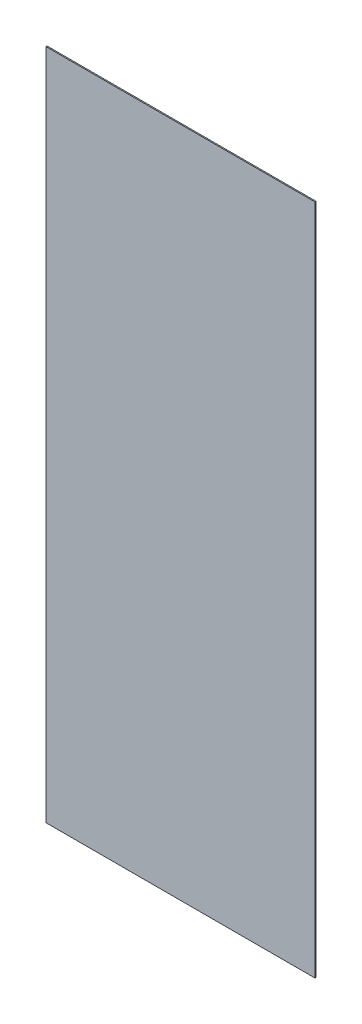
from build123d import *

# Parameters (mm, degrees)
SKETCH1_W      = 609.6
SKETCH1_H      = 1524
EXTRUDE1_DEPTH = 2.54


with BuildPart() as part:
    # Sketch1 → Extrude1 (new body)
    with BuildSketch(Plane.XY):
        with Locations((-304.8, 762)):
            Rectangle(SKETCH1_W, SKETCH1_H)
    extrude(amount=EXTRUDE1_DEPTH)


solid = part.part
